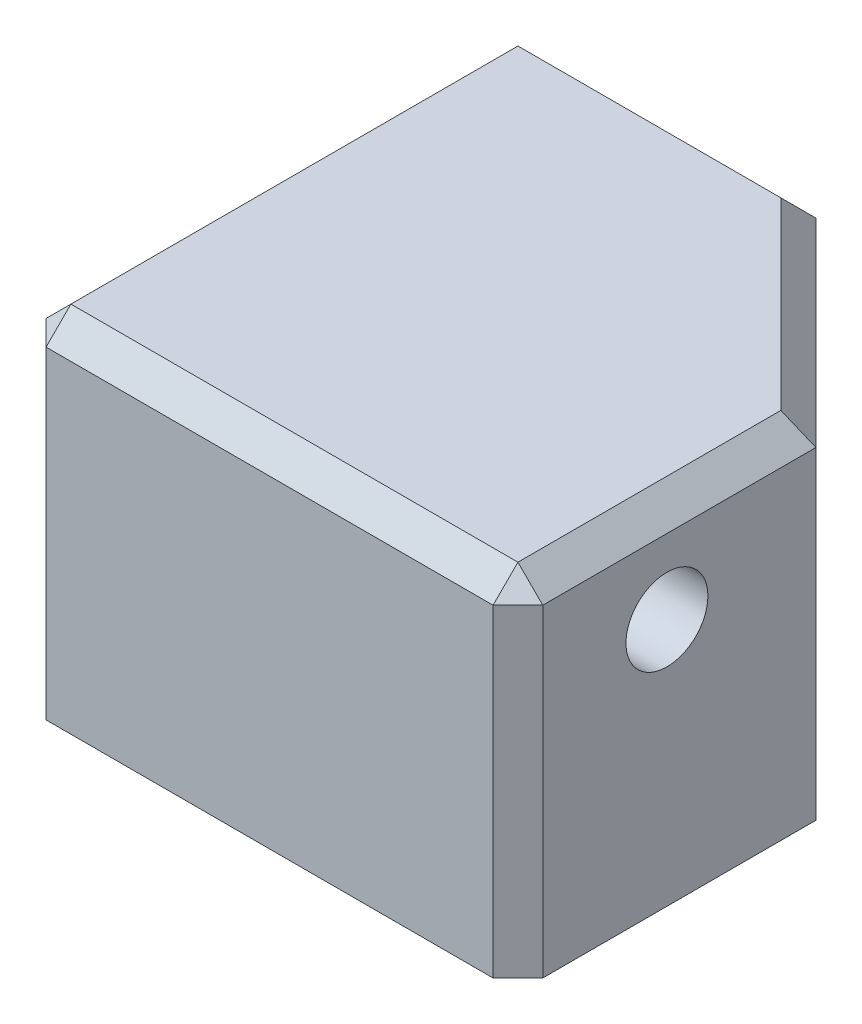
ISO-10303-21;
HEADER;
FILE_DESCRIPTION(('STEP AP214'),'2;1');
FILE_NAME('part.step','',(''),(''),'','','');
FILE_SCHEMA(('AUTOMOTIVE_DESIGN { 1 0 10303 214 1 1 1 1 }'));
ENDSEC;
DATA;
#1=APPLICATION_CONTEXT('core data for automotive mechanical design processes');
#2=APPLICATION_PROTOCOL_DEFINITION('international standard','automotive_design',2000,#1);
#3=PRODUCT_CONTEXT('',#1,'mechanical');
#4=PRODUCT('Part','Part','',(#3));
#5=PRODUCT_RELATED_PRODUCT_CATEGORY('part','',(#4));
#6=PRODUCT_DEFINITION_FORMATION('','',#4);
#7=PRODUCT_DEFINITION_CONTEXT('part definition',#1,'design');
#8=PRODUCT_DEFINITION('design','',#6,#7);
#9=PRODUCT_DEFINITION_SHAPE('','',#8);
#10=(LENGTH_UNIT() NAMED_UNIT(*) SI_UNIT(.MILLI.,.METRE.));
#11=(NAMED_UNIT(*) PLANE_ANGLE_UNIT() SI_UNIT($,.RADIAN.));
#12=(NAMED_UNIT(*) SI_UNIT($,.STERADIAN.) SOLID_ANGLE_UNIT());
#13=UNCERTAINTY_MEASURE_WITH_UNIT(LENGTH_MEASURE(1.E-05),#10,'distance_accuracy_value','');
#14=(GEOMETRIC_REPRESENTATION_CONTEXT(3) GLOBAL_UNCERTAINTY_ASSIGNED_CONTEXT((#13)) GLOBAL_UNIT_ASSIGNED_CONTEXT((#10,
#11,#12)) REPRESENTATION_CONTEXT('',''));
#15=CARTESIAN_POINT('',(0.,0.,0.));
#16=DIRECTION('',(0.,0.,1.));
#17=DIRECTION('',(1.,0.,0.));
#18=AXIS2_PLACEMENT_3D('',#15,#16,#17);
#19=CARTESIAN_POINT('',(10.,7.,0.));
#20=DIRECTION('',(0.,0.,-1.));
#21=DIRECTION('',(-1.,0.,0.));
#22=AXIS2_PLACEMENT_3D('',#19,#20,#21);
#23=PLANE('',#22);
#24=DIRECTION('',(1.,0.,0.));
#25=VECTOR('',#24,1.);
#26=CARTESIAN_POINT('',(10.,0.,0.));
#27=LINE('',#26,#25);
#28=CARTESIAN_POINT('',(0.5,0.,0.));
#29=VERTEX_POINT('',#28);
#30=CARTESIAN_POINT('',(9.5,0.,0.));
#31=VERTEX_POINT('',#30);
#32=EDGE_CURVE('E209',#29,#31,#27,.T.);
#33=ORIENTED_EDGE('',*,*,#32,.T.);
#34=DIRECTION('',(0.,1.,0.));
#35=VECTOR('',#34,1.);
#36=CARTESIAN_POINT('',(9.5,7.,0.));
#37=LINE('',#36,#35);
#38=CARTESIAN_POINT('',(9.5,6.5,0.));
#39=VERTEX_POINT('',#38);
#40=EDGE_CURVE('E410',#31,#39,#37,.T.);
#41=ORIENTED_EDGE('',*,*,#40,.T.);
#42=DIRECTION('',(-1.,0.,0.));
#43=VECTOR('',#42,1.);
#44=CARTESIAN_POINT('',(10.,6.5,0.));
#45=LINE('',#44,#43);
#46=CARTESIAN_POINT('',(0.5,6.5,0.));
#47=VERTEX_POINT('',#46);
#48=EDGE_CURVE('E408',#39,#47,#45,.T.);
#49=ORIENTED_EDGE('',*,*,#48,.T.);
#50=DIRECTION('',(0.,-1.,0.));
#51=VECTOR('',#50,1.);
#52=CARTESIAN_POINT('',(0.5,7.,0.));
#53=LINE('',#52,#51);
#54=EDGE_CURVE('E406',#47,#29,#53,.T.);
#55=ORIENTED_EDGE('',*,*,#54,.T.);
#56=EDGE_LOOP('',(#33,#41,#49,#55));
#57=FACE_BOUND('',#56,.T.);
#58=ADVANCED_FACE('F37',(#57),#23,.F.);
#59=CARTESIAN_POINT('',(10.,7.,-6.));
#60=DIRECTION('',(-1.,0.,0.));
#61=DIRECTION('',(0.,0.,1.));
#62=AXIS2_PLACEMENT_3D('',#59,#60,#61);
#63=PLANE('',#62);
#64=CARTESIAN_POINT('',(10.,5.,-3.));
#65=DIRECTION('',(1.,0.,0.));
#66=DIRECTION('',(0.,0.,-1.));
#67=AXIS2_PLACEMENT_3D('',#64,#65,#66);
#68=CIRCLE('',#67,0.824999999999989);
#69=CARTESIAN_POINT('',(10.,5.,-3.82499999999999));
#70=VERTEX_POINT('',#69);
#71=EDGE_CURVE('E203',#70,#70,#68,.T.);
#72=ORIENTED_EDGE('',*,*,#71,.F.);
#73=EDGE_LOOP('',(#72));
#74=FACE_BOUND('',#73,.T.);
#75=DIRECTION('',(0.,0.,1.));
#76=VECTOR('',#75,1.);
#77=CARTESIAN_POINT('',(10.,6.5,-6.));
#78=LINE('',#77,#76);
#79=CARTESIAN_POINT('',(10.,6.5,-6.));
#80=VERTEX_POINT('',#79);
#81=CARTESIAN_POINT('',(10.,6.5,-0.500000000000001));
#82=VERTEX_POINT('',#81);
#83=EDGE_CURVE('E381',#80,#82,#78,.T.);
#84=ORIENTED_EDGE('',*,*,#83,.T.);
#85=DIRECTION('',(0.,-1.,0.));
#86=VECTOR('',#85,1.);
#87=CARTESIAN_POINT('',(10.,7.,-0.500000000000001));
#88=LINE('',#87,#86);
#89=CARTESIAN_POINT('',(10.,0.,-0.500000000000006));
#90=VERTEX_POINT('',#89);
#91=EDGE_CURVE('E386',#82,#90,#88,.T.);
#92=ORIENTED_EDGE('',*,*,#91,.T.);
#93=DIRECTION('',(0.,0.,-1.));
#94=VECTOR('',#93,1.);
#95=CARTESIAN_POINT('',(10.,0.,-6.));
#96=LINE('',#95,#94);
#97=CARTESIAN_POINT('',(10.,0.,-6.));
#98=VERTEX_POINT('',#97);
#99=EDGE_CURVE('E212',#90,#98,#96,.T.);
#100=ORIENTED_EDGE('',*,*,#99,.T.);
#101=DIRECTION('',(0.,-1.,0.));
#102=VECTOR('',#101,1.);
#103=CARTESIAN_POINT('',(10.,7.,-6.));
#104=LINE('',#103,#102);
#105=EDGE_CURVE('E226',#80,#98,#104,.T.);
#106=ORIENTED_EDGE('',*,*,#105,.F.);
#107=EDGE_LOOP('',(#84,#92,#100,#106));
#108=FACE_BOUND('',#107,.T.);
#109=ADVANCED_FACE('F270',(#74,#108),#63,.F.);
#110=CARTESIAN_POINT('',(6.,7.,-10.));
#111=DIRECTION('',(-0.707106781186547,0.,0.707106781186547));
#112=DIRECTION('',(0.707106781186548,0.,0.707106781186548));
#113=AXIS2_PLACEMENT_3D('',#110,#111,#112);
#114=PLANE('',#113);
#115=CARTESIAN_POINT('',(8.,5.,-8.00000000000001));
#116=DIRECTION('',(0.707106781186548,0.,-0.707106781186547));
#117=DIRECTION('',(-0.707106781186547,0.,-0.707106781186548));
#118=AXIS2_PLACEMENT_3D('',#115,#116,#117);
#119=CIRCLE('',#118,0.824999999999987);
#120=CARTESIAN_POINT('',(7.41663690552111,5.,-8.5833630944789));
#121=VERTEX_POINT('',#120);
#122=EDGE_CURVE('E181',#121,#121,#119,.T.);
#123=ORIENTED_EDGE('',*,*,#122,.F.);
#124=EDGE_LOOP('',(#123));
#125=FACE_BOUND('',#124,.T.);
#126=DIRECTION('',(0.,-1.,0.));
#127=VECTOR('',#126,1.);
#128=CARTESIAN_POINT('',(6.,7.,-10.));
#129=LINE('',#128,#127);
#130=CARTESIAN_POINT('',(6.,6.5,-10.));
#131=VERTEX_POINT('',#130);
#132=CARTESIAN_POINT('',(6.,0.,-10.));
#133=VERTEX_POINT('',#132);
#134=EDGE_CURVE('E224',#131,#133,#129,.T.);
#135=ORIENTED_EDGE('',*,*,#134,.F.);
#136=DIRECTION('',(0.707106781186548,0.,0.707106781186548));
#137=VECTOR('',#136,1.);
#138=CARTESIAN_POINT('',(6.,6.5,-10.));
#139=LINE('',#138,#137);
#140=EDGE_CURVE('E11',#131,#80,#139,.T.);
#141=ORIENTED_EDGE('',*,*,#140,.T.);
#142=ORIENTED_EDGE('',*,*,#105,.T.);
#143=DIRECTION('',(-0.707106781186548,0.,-0.707106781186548));
#144=VECTOR('',#143,1.);
#145=CARTESIAN_POINT('',(6.,0.,-10.));
#146=LINE('',#145,#144);
#147=EDGE_CURVE('E215',#98,#133,#146,.T.);
#148=ORIENTED_EDGE('',*,*,#147,.T.);
#149=EDGE_LOOP('',(#135,#141,#142,#148));
#150=FACE_BOUND('',#149,.T.);
#151=ADVANCED_FACE('F266',(#125,#150),#114,.F.);
#152=CARTESIAN_POINT('',(0.,7.,-10.));
#153=DIRECTION('',(0.,0.,1.));
#154=DIRECTION('',(1.,0.,0.));
#155=AXIS2_PLACEMENT_3D('',#152,#153,#154);
#156=PLANE('',#155);
#157=CARTESIAN_POINT('',(3.,5.,-10.));
#158=DIRECTION('',(0.,0.,-1.));
#159=DIRECTION('',(-1.,0.,0.));
#160=AXIS2_PLACEMENT_3D('',#157,#158,#159);
#161=CIRCLE('',#160,0.824999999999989);
#162=CARTESIAN_POINT('',(2.17500000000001,5.,-10.));
#163=VERTEX_POINT('',#162);
#164=EDGE_CURVE('E197',#163,#163,#161,.T.);
#165=ORIENTED_EDGE('',*,*,#164,.F.);
#166=EDGE_LOOP('',(#165));
#167=FACE_BOUND('',#166,.T.);
#168=DIRECTION('',(-1.,0.,0.));
#169=VECTOR('',#168,1.);
#170=CARTESIAN_POINT('',(0.,0.,-10.));
#171=LINE('',#170,#169);
#172=CARTESIAN_POINT('',(0.5,0.,-10.));
#173=VERTEX_POINT('',#172);
#174=EDGE_CURVE('E218',#133,#173,#171,.T.);
#175=ORIENTED_EDGE('',*,*,#174,.T.);
#176=DIRECTION('',(0.,1.,0.));
#177=VECTOR('',#176,1.);
#178=CARTESIAN_POINT('',(0.5,7.,-10.));
#179=LINE('',#178,#177);
#180=CARTESIAN_POINT('',(0.5,6.5,-10.));
#181=VERTEX_POINT('',#180);
#182=EDGE_CURVE('E338',#173,#181,#179,.T.);
#183=ORIENTED_EDGE('',*,*,#182,.T.);
#184=DIRECTION('',(1.,0.,0.));
#185=VECTOR('',#184,1.);
#186=CARTESIAN_POINT('',(0.,6.5,-10.));
#187=LINE('',#186,#185);
#188=EDGE_CURVE('E332',#181,#131,#187,.T.);
#189=ORIENTED_EDGE('',*,*,#188,.T.);
#190=ORIENTED_EDGE('',*,*,#134,.T.);
#191=EDGE_LOOP('',(#175,#183,#189,#190));
#192=FACE_BOUND('',#191,.T.);
#193=ADVANCED_FACE('F262',(#167,#192),#156,.F.);
#194=CARTESIAN_POINT('',(0.,7.,0.));
#195=DIRECTION('',(1.,0.,0.));
#196=DIRECTION('',(0.,0.,-1.));
#197=AXIS2_PLACEMENT_3D('',#194,#195,#196);
#198=PLANE('',#197);
#199=DIRECTION('',(0.,0.,-1.));
#200=VECTOR('',#199,1.);
#201=CARTESIAN_POINT('',(0.,6.5,0.));
#202=LINE('',#201,#200);
#203=CARTESIAN_POINT('',(0.,6.5,-0.500000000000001));
#204=VERTEX_POINT('',#203);
#205=CARTESIAN_POINT('',(0.,6.5,-9.5));
#206=VERTEX_POINT('',#205);
#207=EDGE_CURVE('E343',#204,#206,#202,.T.);
#208=ORIENTED_EDGE('',*,*,#207,.T.);
#209=DIRECTION('',(0.,-1.,0.));
#210=VECTOR('',#209,1.);
#211=CARTESIAN_POINT('',(0.,7.,-9.5));
#212=LINE('',#211,#210);
#213=CARTESIAN_POINT('',(0.,0.,-9.5));
#214=VERTEX_POINT('',#213);
#215=EDGE_CURVE('E339',#206,#214,#212,.T.);
#216=ORIENTED_EDGE('',*,*,#215,.T.);
#217=DIRECTION('',(0.,0.,1.));
#218=VECTOR('',#217,1.);
#219=CARTESIAN_POINT('',(0.,0.,0.));
#220=LINE('',#219,#218);
#221=CARTESIAN_POINT('',(0.,0.,-0.500000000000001));
#222=VERTEX_POINT('',#221);
#223=EDGE_CURVE('E221',#214,#222,#220,.T.);
#224=ORIENTED_EDGE('',*,*,#223,.T.);
#225=DIRECTION('',(0.,1.,0.));
#226=VECTOR('',#225,1.);
#227=CARTESIAN_POINT('',(0.,7.,-0.500000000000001));
#228=LINE('',#227,#226);
#229=EDGE_CURVE('E412',#222,#204,#228,.T.);
#230=ORIENTED_EDGE('',*,*,#229,.T.);
#231=EDGE_LOOP('',(#208,#216,#224,#230));
#232=FACE_BOUND('',#231,.T.);
#233=ADVANCED_FACE('F256',(#232),#198,.F.);
#234=CARTESIAN_POINT('',(0.,7.,0.));
#235=DIRECTION('',(0.,-1.,0.));
#236=DIRECTION('',(0.,0.,-1.));
#237=AXIS2_PLACEMENT_3D('',#234,#235,#236);
#238=PLANE('',#237);
#239=DIRECTION('',(1.,0.,0.));
#240=VECTOR('',#239,1.);
#241=CARTESIAN_POINT('',(0.,7.,-0.5));
#242=LINE('',#241,#240);
#243=CARTESIAN_POINT('',(0.5,7.,-0.500000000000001));
#244=VERTEX_POINT('',#243);
#245=CARTESIAN_POINT('',(9.5,7.,-0.500000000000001));
#246=VERTEX_POINT('',#245);
#247=EDGE_CURVE('E348',#244,#246,#242,.T.);
#248=ORIENTED_EDGE('',*,*,#247,.T.);
#249=DIRECTION('',(0.,0.,-1.));
#250=VECTOR('',#249,1.);
#251=CARTESIAN_POINT('',(9.5,7.,0.));
#252=LINE('',#251,#250);
#253=CARTESIAN_POINT('',(9.5,7.,-5.79289321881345));
#254=VERTEX_POINT('',#253);
#255=EDGE_CURVE('E46',#246,#254,#252,.T.);
#256=ORIENTED_EDGE('',*,*,#255,.T.);
#257=DIRECTION('',(-0.707106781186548,0.,-0.707106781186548));
#258=VECTOR('',#257,1.);
#259=CARTESIAN_POINT('',(7.64644660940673,7.,-7.64644660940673));
#260=LINE('',#259,#258);
#261=CARTESIAN_POINT('',(5.79289321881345,7.,-9.5));
#262=VERTEX_POINT('',#261);
#263=EDGE_CURVE('E61',#254,#262,#260,.T.);
#264=ORIENTED_EDGE('',*,*,#263,.T.);
#265=DIRECTION('',(-1.,0.,0.));
#266=VECTOR('',#265,1.);
#267=CARTESIAN_POINT('',(0.,7.,-9.5));
#268=LINE('',#267,#266);
#269=CARTESIAN_POINT('',(0.5,7.,-9.5));
#270=VERTEX_POINT('',#269);
#271=EDGE_CURVE('E350',#262,#270,#268,.T.);
#272=ORIENTED_EDGE('',*,*,#271,.T.);
#273=DIRECTION('',(0.,0.,1.));
#274=VECTOR('',#273,1.);
#275=CARTESIAN_POINT('',(0.5,7.,0.));
#276=LINE('',#275,#274);
#277=EDGE_CURVE('E341',#270,#244,#276,.T.);
#278=ORIENTED_EDGE('',*,*,#277,.T.);
#279=EDGE_LOOP('',(#248,#256,#264,#272,#278));
#280=FACE_BOUND('',#279,.T.);
#281=ADVANCED_FACE('F252',(#280),#238,.F.);
#282=CARTESIAN_POINT('',(0.,0.,0.));
#283=DIRECTION('',(0.,-1.,0.));
#284=DIRECTION('',(0.,0.,-1.));
#285=AXIS2_PLACEMENT_3D('',#282,#283,#284);
#286=PLANE('',#285);
#287=CARTESIAN_POINT('',(5.1,0.,-8.));
#288=DIRECTION('',(0.,-1.,0.));
#289=DIRECTION('',(0.,0.,-1.));
#290=AXIS2_PLACEMENT_3D('',#287,#288,#289);
#291=CIRCLE('',#290,0.625);
#292=CARTESIAN_POINT('',(5.1,0.,-8.625));
#293=VERTEX_POINT('',#292);
#294=EDGE_CURVE('E165',#293,#293,#291,.T.);
#295=ORIENTED_EDGE('',*,*,#294,.F.);
#296=EDGE_LOOP('',(#295));
#297=FACE_BOUND('',#296,.T.);
#298=CARTESIAN_POINT('',(8.,0.,-5.1));
#299=DIRECTION('',(0.,-1.,0.));
#300=DIRECTION('',(0.,0.,-1.));
#301=AXIS2_PLACEMENT_3D('',#298,#299,#300);
#302=CIRCLE('',#301,0.624999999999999);
#303=CARTESIAN_POINT('',(8.,0.,-5.725));
#304=VERTEX_POINT('',#303);
#305=EDGE_CURVE('E164',#304,#304,#302,.T.);
#306=ORIENTED_EDGE('',*,*,#305,.F.);
#307=EDGE_LOOP('',(#306));
#308=FACE_BOUND('',#307,.T.);
#309=CARTESIAN_POINT('',(2.,0.,-2.));
#310=DIRECTION('',(0.,-1.,0.));
#311=DIRECTION('',(0.,0.,-1.));
#312=AXIS2_PLACEMENT_3D('',#309,#310,#311);
#313=CIRCLE('',#312,0.625);
#314=CARTESIAN_POINT('',(2.,0.,-2.625));
#315=VERTEX_POINT('',#314);
#316=EDGE_CURVE('E175',#315,#315,#313,.T.);
#317=ORIENTED_EDGE('',*,*,#316,.F.);
#318=EDGE_LOOP('',(#317));
#319=FACE_BOUND('',#318,.T.);
#320=ORIENTED_EDGE('',*,*,#99,.F.);
#321=DIRECTION('',(0.707106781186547,0.,-0.707106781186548));
#322=VECTOR('',#321,1.);
#323=CARTESIAN_POINT('',(4.75,0.,4.75));
#324=LINE('',#323,#322);
#325=EDGE_CURVE('E400',#90,#31,#324,.F.);
#326=ORIENTED_EDGE('',*,*,#325,.T.);
#327=ORIENTED_EDGE('',*,*,#32,.F.);
#328=DIRECTION('',(0.707106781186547,0.,0.707106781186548));
#329=VECTOR('',#328,1.);
#330=CARTESIAN_POINT('',(0.25,0.,-0.25));
#331=LINE('',#330,#329);
#332=EDGE_CURVE('E397',#29,#222,#331,.F.);
#333=ORIENTED_EDGE('',*,*,#332,.T.);
#334=ORIENTED_EDGE('',*,*,#223,.F.);
#335=DIRECTION('',(-0.707106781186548,0.,0.707106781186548));
#336=VECTOR('',#335,1.);
#337=CARTESIAN_POINT('',(-4.75,0.,-4.75));
#338=LINE('',#337,#336);
#339=EDGE_CURVE('E391',#214,#173,#338,.F.);
#340=ORIENTED_EDGE('',*,*,#339,.T.);
#341=ORIENTED_EDGE('',*,*,#174,.F.);
#342=ORIENTED_EDGE('',*,*,#147,.F.);
#343=EDGE_LOOP('',(#320,#326,#327,#333,#334,#340,#341,#342));
#344=FACE_BOUND('',#343,.T.);
#345=ADVANCED_FACE('F250',(#297,#308,#319,#344),#286,.T.);
#346=CARTESIAN_POINT('',(3.,5.,-3.));
#347=DIRECTION('',(1.,0.,0.));
#348=DIRECTION('',(0.,0.,-1.));
#349=AXIS2_PLACEMENT_3D('',#346,#347,#348);
#350=CONICAL_SURFACE('',#349,0.824999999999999,0.785398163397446);
#351=CARTESIAN_POINT('',(2.5875,5.,-2.5875));
#352=CARTESIAN_POINT('',(2.58749515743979,4.98861170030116,-2.58749515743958));
#353=CARTESIAN_POINT('',(2.58773324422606,4.97721942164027,-2.58773324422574));
#354=CARTESIAN_POINT('',(2.58962789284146,4.93173148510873,-2.58962789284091));
#355=CARTESIAN_POINT('',(2.59316826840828,4.89775953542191,-2.59316826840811));
#356=CARTESIAN_POINT('',(2.60411432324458,4.83107152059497,-2.6041143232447));
#357=CARTESIAN_POINT('',(2.61152830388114,4.79835831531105,-2.61152830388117));
#358=CARTESIAN_POINT('',(2.63345857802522,4.72086257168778,-2.63345857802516));
#359=CARTESIAN_POINT('',(2.64966242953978,4.67704471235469,-2.64966242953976));
#360=CARTESIAN_POINT('',(2.68670271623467,4.59322571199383,-2.68670271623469));
#361=CARTESIAN_POINT('',(2.70757428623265,4.55325699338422,-2.70757428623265));
#362=CARTESIAN_POINT('',(2.75175738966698,4.47808626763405,-2.75175738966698));
#363=CARTESIAN_POINT('',(2.77498311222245,4.44278134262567,-2.77498311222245));
#364=CARTESIAN_POINT('',(2.82350738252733,4.37505173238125,-2.82350738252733));
#365=CARTESIAN_POINT('',(2.8488098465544,4.34263274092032,-2.8488098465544));
#366=CARTESIAN_POINT('',(2.90004266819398,4.28124439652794,-2.90004266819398));
#367=CARTESIAN_POINT('',(2.92592757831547,4.25219819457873,-2.92592757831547));
#368=CARTESIAN_POINT('',(2.9786214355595,4.19618590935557,-2.9786214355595));
#369=CARTESIAN_POINT('',(3.00542570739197,4.16921106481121,-3.00542570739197));
#370=CARTESIAN_POINT('',(3.03258840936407,4.14303099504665,-3.03258840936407));
#371=B_SPLINE_CURVE_WITH_KNOTS('',3,(#351,#352,#353,#354,#355,#356,#357,#358,#359,#360,#361,
#362,#363,#364,#365,#366,#367,#368,#369,#370),.UNSPECIFIED.,.F.,.F.,(4,2,2,2,2,2,2,2,2,4),(0.,
0.0341720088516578,0.136630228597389,0.23930892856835,0.386807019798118,0.535455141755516,
0.679894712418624,0.824613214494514,0.964736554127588,1.10423019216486),.UNSPECIFIED.);
#372=CARTESIAN_POINT('',(3.,4.175,-3.));
#373=VERTEX_POINT('',#372);
#374=CARTESIAN_POINT('',(2.5875,5.,-2.5875));
#375=VERTEX_POINT('',#374);
#376=EDGE_CURVE('E228',#373,#375,#371,.F.);
#377=ORIENTED_EDGE('',*,*,#376,.T.);
#378=CARTESIAN_POINT('',(2.5875,5.,-2.5875));
#379=CARTESIAN_POINT('',(2.58749515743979,5.01138829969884,-2.58749515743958));
#380=CARTESIAN_POINT('',(2.58773324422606,5.02278057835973,-2.58773324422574));
#381=CARTESIAN_POINT('',(2.58962789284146,5.06826851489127,-2.58962789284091));
#382=CARTESIAN_POINT('',(2.59316826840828,5.1022404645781,-2.59316826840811));
#383=CARTESIAN_POINT('',(2.60411432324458,5.16892847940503,-2.6041143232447));
#384=CARTESIAN_POINT('',(2.61152830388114,5.20164168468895,-2.61152830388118));
#385=CARTESIAN_POINT('',(2.63345857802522,5.27913742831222,-2.63345857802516));
#386=CARTESIAN_POINT('',(2.64966242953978,5.32295528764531,-2.64966242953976));
#387=CARTESIAN_POINT('',(2.68670271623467,5.40677428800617,-2.68670271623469));
#388=CARTESIAN_POINT('',(2.70757428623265,5.44674300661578,-2.70757428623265));
#389=CARTESIAN_POINT('',(2.75175738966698,5.52191373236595,-2.75175738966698));
#390=CARTESIAN_POINT('',(2.77498311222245,5.55721865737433,-2.77498311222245));
#391=CARTESIAN_POINT('',(2.82350738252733,5.62494826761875,-2.82350738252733));
#392=CARTESIAN_POINT('',(2.8488098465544,5.65736725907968,-2.8488098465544));
#393=CARTESIAN_POINT('',(2.90004266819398,5.71875560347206,-2.90004266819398));
#394=CARTESIAN_POINT('',(2.92592757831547,5.74780180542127,-2.92592757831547));
#395=CARTESIAN_POINT('',(2.9786214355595,5.80381409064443,-2.9786214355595));
#396=CARTESIAN_POINT('',(3.00542570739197,5.83078893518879,-3.00542570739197));
#397=CARTESIAN_POINT('',(3.03258840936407,5.85696900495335,-3.03258840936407));
#398=B_SPLINE_CURVE_WITH_KNOTS('',3,(#378,#379,#380,#381,#382,#383,#384,#385,#386,#387,#388,
#389,#390,#391,#392,#393,#394,#395,#396,#397),.UNSPECIFIED.,.F.,.F.,(4,2,2,2,2,2,2,2,2,4),(0.,
0.0341720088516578,0.13663022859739,0.23930892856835,0.386807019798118,0.535455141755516,
0.679894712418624,0.824613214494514,0.964736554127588,1.10423019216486),.UNSPECIFIED.);
#399=CARTESIAN_POINT('',(3.,5.82499999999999,-3.));
#400=VERTEX_POINT('',#399);
#401=EDGE_CURVE('E236',#375,#400,#398,.T.);
#402=ORIENTED_EDGE('',*,*,#401,.T.);
#403=CARTESIAN_POINT('',(3.,5.,-3.));
#404=DIRECTION('',(1.,0.,0.));
#405=DIRECTION('',(0.,0.,-1.));
#406=AXIS2_PLACEMENT_3D('',#403,#404,#405);
#407=CIRCLE('',#406,0.824999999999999);
#408=EDGE_CURVE('E206',#400,#373,#407,.T.);
#409=ORIENTED_EDGE('',*,*,#408,.T.);
#410=EDGE_LOOP('',(#377,#402,#409));
#411=FACE_BOUND('',#410,.T.);
#412=ADVANCED_FACE('F245',(#411),#350,.F.);
#413=CARTESIAN_POINT('',(10.,5.,-3.));
#414=DIRECTION('',(1.,0.,0.));
#415=DIRECTION('',(0.,0.,-1.));
#416=AXIS2_PLACEMENT_3D('',#413,#414,#415);
#417=CYLINDRICAL_SURFACE('',#416,0.824999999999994);
#418=CARTESIAN_POINT('',(3.,5.,-3.));
#419=DIRECTION('',(0.707106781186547,0.,0.707106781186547));
#420=DIRECTION('',(0.707106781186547,0.,-0.707106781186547));
#421=AXIS2_PLACEMENT_3D('',#418,#419,#420);
#422=ELLIPSE('',#421,1.16672618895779,0.824999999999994);
#423=CARTESIAN_POINT('',(3.20625,5.79880281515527,-3.20625));
#424=VERTEX_POINT('',#423);
#425=EDGE_CURVE('E424',#400,#424,#422,.F.);
#426=ORIENTED_EDGE('',*,*,#425,.T.);
#427=CARTESIAN_POINT('',(3.41249999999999,5.,-3.));
#428=DIRECTION('',(-0.707106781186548,0.,0.707106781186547));
#429=DIRECTION('',(0.707106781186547,0.,0.707106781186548));
#430=AXIS2_PLACEMENT_3D('',#427,#428,#429);
#431=ELLIPSE('',#430,1.16672618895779,0.824999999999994);
#432=CARTESIAN_POINT('',(3.29168154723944,5.81610532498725,-3.12081845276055));
#433=VERTEX_POINT('',#432);
#434=EDGE_CURVE('E194',#424,#433,#431,.F.);
#435=ORIENTED_EDGE('',*,*,#434,.T.);
#436=CARTESIAN_POINT('',(3.,5.,-3.));
#437=DIRECTION('',(0.38268343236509,0.,0.923879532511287));
#438=DIRECTION('',(0.923879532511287,0.,-0.38268343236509));
#439=AXIS2_PLACEMENT_3D('',#436,#437,#438);
#440=ELLIPSE('',#439,2.155828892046,0.824999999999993);
#441=CARTESIAN_POINT('',(3.29168154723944,4.18389467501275,-3.12081845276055));
#442=VERTEX_POINT('',#441);
#443=EDGE_CURVE('E188',#433,#442,#440,.F.);
#444=ORIENTED_EDGE('',*,*,#443,.T.);
#445=CARTESIAN_POINT('',(3.41249999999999,5.,-3.));
#446=DIRECTION('',(-0.707106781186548,0.,0.707106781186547));
#447=DIRECTION('',(0.707106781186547,0.,0.707106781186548));
#448=AXIS2_PLACEMENT_3D('',#445,#446,#447);
#449=ELLIPSE('',#448,1.16672618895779,0.824999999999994);
#450=CARTESIAN_POINT('',(3.20625,4.20119718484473,-3.20625));
#451=VERTEX_POINT('',#450);
#452=EDGE_CURVE('E191',#442,#451,#449,.F.);
#453=ORIENTED_EDGE('',*,*,#452,.T.);
#454=EDGE_CURVE('E426',#451,#373,#422,.F.);
#455=ORIENTED_EDGE('',*,*,#454,.T.);
#456=ORIENTED_EDGE('',*,*,#408,.F.);
#457=EDGE_LOOP('',(#426,#435,#444,#453,#455,#456));
#458=FACE_BOUND('',#457,.T.);
#459=ORIENTED_EDGE('',*,*,#71,.T.);
#460=EDGE_LOOP('',(#459));
#461=FACE_BOUND('',#460,.T.);
#462=ADVANCED_FACE('F249',(#458,#461),#417,.F.);
#463=CARTESIAN_POINT('',(3.,5.,-10.));
#464=DIRECTION('',(0.,0.,-1.));
#465=DIRECTION('',(-1.,0.,0.));
#466=AXIS2_PLACEMENT_3D('',#463,#464,#465);
#467=CYLINDRICAL_SURFACE('',#466,0.824999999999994);
#468=ORIENTED_EDGE('',*,*,#164,.T.);
#469=EDGE_LOOP('',(#468));
#470=FACE_BOUND('',#469,.T.);
#471=CARTESIAN_POINT('',(3.,5.,-3.));
#472=DIRECTION('',(-0.923879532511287,0.,-0.38268343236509));
#473=DIRECTION('',(0.38268343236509,0.,-0.923879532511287));
#474=AXIS2_PLACEMENT_3D('',#471,#472,#473);
#475=ELLIPSE('',#474,2.155828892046,0.824999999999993);
#476=CARTESIAN_POINT('',(3.12081845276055,4.18389467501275,-3.29168154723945));
#477=VERTEX_POINT('',#476);
#478=CARTESIAN_POINT('',(3.12081845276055,5.81610532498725,-3.29168154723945));
#479=VERTEX_POINT('',#478);
#480=EDGE_CURVE('E422',#477,#479,#475,.F.);
#481=ORIENTED_EDGE('',*,*,#480,.T.);
#482=CARTESIAN_POINT('',(3.,5.,-3.41249999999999));
#483=DIRECTION('',(-0.707106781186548,0.,0.707106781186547));
#484=DIRECTION('',(-0.707106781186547,0.,-0.707106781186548));
#485=AXIS2_PLACEMENT_3D('',#482,#483,#484);
#486=ELLIPSE('',#485,1.16672618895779,0.824999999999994);
#487=EDGE_CURVE('E416',#479,#424,#486,.F.);
#488=ORIENTED_EDGE('',*,*,#487,.T.);
#489=ORIENTED_EDGE('',*,*,#425,.F.);
#490=CARTESIAN_POINT('',(3.,5.,-3.));
#491=DIRECTION('',(0.,0.,-1.));
#492=DIRECTION('',(-1.,0.,0.));
#493=AXIS2_PLACEMENT_3D('',#490,#491,#492);
#494=CIRCLE('',#493,0.824999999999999);
#495=EDGE_CURVE('E200',#373,#400,#494,.T.);
#496=ORIENTED_EDGE('',*,*,#495,.F.);
#497=ORIENTED_EDGE('',*,*,#454,.F.);
#498=EDGE_CURVE('E418',#451,#477,#486,.F.);
#499=ORIENTED_EDGE('',*,*,#498,.T.);
#500=EDGE_LOOP('',(#481,#488,#489,#496,#497,#499));
#501=FACE_BOUND('',#500,.T.);
#502=ADVANCED_FACE('F436',(#470,#501),#467,.F.);
#503=CARTESIAN_POINT('',(3.,5.,-3.));
#504=DIRECTION('',(0.,0.,-1.));
#505=DIRECTION('',(-1.,0.,0.));
#506=AXIS2_PLACEMENT_3D('',#503,#504,#505);
#507=CONICAL_SURFACE('',#506,0.824999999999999,0.785398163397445);
#508=ORIENTED_EDGE('',*,*,#495,.T.);
#509=ORIENTED_EDGE('',*,*,#401,.F.);
#510=ORIENTED_EDGE('',*,*,#376,.F.);
#511=EDGE_LOOP('',(#508,#509,#510));
#512=FACE_BOUND('',#511,.T.);
#513=ADVANCED_FACE('F241',(#512),#507,.F.);
#514=CARTESIAN_POINT('',(3.20624999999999,5.,-3.20625));
#515=DIRECTION('',(-0.707106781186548,0.,0.707106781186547));
#516=DIRECTION('',(0.707106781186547,0.,0.707106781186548));
#517=AXIS2_PLACEMENT_3D('',#514,#515,#516);
#518=PLANE('',#517);
#519=ORIENTED_EDGE('',*,*,#487,.F.);
#520=CARTESIAN_POINT('',(3.20624999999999,5.,-3.20625));
#521=DIRECTION('',(0.707106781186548,0.,-0.707106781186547));
#522=DIRECTION('',(-0.707106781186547,0.,-0.707106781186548));
#523=AXIS2_PLACEMENT_3D('',#520,#521,#522);
#524=CIRCLE('',#523,0.824999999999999);
#525=EDGE_CURVE('E185',#479,#433,#524,.T.);
#526=ORIENTED_EDGE('',*,*,#525,.T.);
#527=ORIENTED_EDGE('',*,*,#434,.F.);
#528=EDGE_LOOP('',(#519,#526,#527));
#529=FACE_BOUND('',#528,.T.);
#530=ADVANCED_FACE('F445',(#529),#518,.F.);
#531=EDGE_CURVE('E184',#442,#477,#524,.T.);
#532=ORIENTED_EDGE('',*,*,#531,.T.);
#533=ORIENTED_EDGE('',*,*,#498,.F.);
#534=ORIENTED_EDGE('',*,*,#452,.F.);
#535=EDGE_LOOP('',(#532,#533,#534));
#536=FACE_BOUND('',#535,.T.);
#537=ADVANCED_FACE('F450',(#536),#518,.F.);
#538=CARTESIAN_POINT('',(8.,5.,-8.));
#539=DIRECTION('',(0.707106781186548,0.,-0.707106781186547));
#540=DIRECTION('',(-0.707106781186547,0.,-0.707106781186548));
#541=AXIS2_PLACEMENT_3D('',#538,#539,#540);
#542=CYLINDRICAL_SURFACE('',#541,0.824999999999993);
#543=ORIENTED_EDGE('',*,*,#122,.T.);
#544=EDGE_LOOP('',(#543));
#545=FACE_BOUND('',#544,.T.);
#546=ORIENTED_EDGE('',*,*,#525,.F.);
#547=ORIENTED_EDGE('',*,*,#480,.F.);
#548=ORIENTED_EDGE('',*,*,#531,.F.);
#549=ORIENTED_EDGE('',*,*,#443,.F.);
#550=EDGE_LOOP('',(#546,#547,#548,#549));
#551=FACE_BOUND('',#550,.T.);
#552=ADVANCED_FACE('F452',(#545,#551),#542,.F.);
#553=CARTESIAN_POINT('',(2.,3.5,-2.));
#554=DIRECTION('',(0.,-1.,0.));
#555=DIRECTION('',(0.,0.,-1.));
#556=AXIS2_PLACEMENT_3D('',#553,#554,#555);
#557=CONICAL_SURFACE('',#556,0.624999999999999,1.02974425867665);
#558=CARTESIAN_POINT('',(2.,3.87553788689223,-2.));
#559=VERTEX_POINT('',#558);
#560=VERTEX_LOOP('',#559);
#561=FACE_BOUND('',#560,.T.);
#562=CARTESIAN_POINT('',(2.,3.5,-2.));
#563=DIRECTION('',(0.,-1.,0.));
#564=DIRECTION('',(0.,0.,-1.));
#565=AXIS2_PLACEMENT_3D('',#562,#563,#564);
#566=CIRCLE('',#565,0.624999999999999);
#567=CARTESIAN_POINT('',(2.,3.5,-2.625));
#568=VERTEX_POINT('',#567);
#569=EDGE_CURVE('E178',#568,#568,#566,.T.);
#570=ORIENTED_EDGE('',*,*,#569,.T.);
#571=EDGE_LOOP('',(#570));
#572=FACE_BOUND('',#571,.T.);
#573=ADVANCED_FACE('F455',(#561,#572),#557,.F.);
#574=CARTESIAN_POINT('',(2.,0.,-2.));
#575=DIRECTION('',(0.,-1.,0.));
#576=DIRECTION('',(0.,0.,-1.));
#577=AXIS2_PLACEMENT_3D('',#574,#575,#576);
#578=CYLINDRICAL_SURFACE('',#577,0.624999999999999);
#579=ORIENTED_EDGE('',*,*,#569,.F.);
#580=EDGE_LOOP('',(#579));
#581=FACE_BOUND('',#580,.T.);
#582=ORIENTED_EDGE('',*,*,#316,.T.);
#583=EDGE_LOOP('',(#582));
#584=FACE_BOUND('',#583,.T.);
#585=ADVANCED_FACE('F459',(#581,#584),#578,.F.);
#586=CARTESIAN_POINT('',(8.,3.5,-5.1));
#587=DIRECTION('',(0.,-1.,0.));
#588=DIRECTION('',(0.,0.,-1.));
#589=AXIS2_PLACEMENT_3D('',#586,#587,#588);
#590=CONICAL_SURFACE('',#589,0.624999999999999,1.02974425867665);
#591=CARTESIAN_POINT('',(8.,3.87553788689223,-5.1));
#592=VERTEX_POINT('',#591);
#593=VERTEX_LOOP('',#592);
#594=FACE_BOUND('',#593,.T.);
#595=CARTESIAN_POINT('',(8.,3.5,-5.1));
#596=DIRECTION('',(0.,-1.,0.));
#597=DIRECTION('',(0.,0.,-1.));
#598=AXIS2_PLACEMENT_3D('',#595,#596,#597);
#599=CIRCLE('',#598,0.624999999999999);
#600=CARTESIAN_POINT('',(8.,3.5,-5.725));
#601=VERTEX_POINT('',#600);
#602=EDGE_CURVE('E168',#601,#601,#599,.T.);
#603=ORIENTED_EDGE('',*,*,#602,.T.);
#604=EDGE_LOOP('',(#603));
#605=FACE_BOUND('',#604,.T.);
#606=ADVANCED_FACE('F463',(#594,#605),#590,.F.);
#607=CARTESIAN_POINT('',(8.,0.,-5.1));
#608=DIRECTION('',(0.,-1.,0.));
#609=DIRECTION('',(0.,0.,-1.));
#610=AXIS2_PLACEMENT_3D('',#607,#608,#609);
#611=CYLINDRICAL_SURFACE('',#610,0.624999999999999);
#612=ORIENTED_EDGE('',*,*,#602,.F.);
#613=EDGE_LOOP('',(#612));
#614=FACE_BOUND('',#613,.T.);
#615=ORIENTED_EDGE('',*,*,#305,.T.);
#616=EDGE_LOOP('',(#615));
#617=FACE_BOUND('',#616,.T.);
#618=ADVANCED_FACE('F158',(#614,#617),#611,.F.);
#619=CARTESIAN_POINT('',(5.1,3.5,-8.));
#620=DIRECTION('',(0.,-1.,0.));
#621=DIRECTION('',(0.,0.,-1.));
#622=AXIS2_PLACEMENT_3D('',#619,#620,#621);
#623=CONICAL_SURFACE('',#622,0.624999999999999,1.02974425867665);
#624=CARTESIAN_POINT('',(5.1,3.87553788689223,-8.));
#625=VERTEX_POINT('',#624);
#626=VERTEX_LOOP('',#625);
#627=FACE_BOUND('',#626,.T.);
#628=CARTESIAN_POINT('',(5.1,3.5,-8.));
#629=DIRECTION('',(0.,-1.,0.));
#630=DIRECTION('',(0.,0.,-1.));
#631=AXIS2_PLACEMENT_3D('',#628,#629,#630);
#632=CIRCLE('',#631,0.624999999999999);
#633=CARTESIAN_POINT('',(5.1,3.5,-8.625));
#634=VERTEX_POINT('',#633);
#635=EDGE_CURVE('E162',#634,#634,#632,.T.);
#636=ORIENTED_EDGE('',*,*,#635,.T.);
#637=EDGE_LOOP('',(#636));
#638=FACE_BOUND('',#637,.T.);
#639=ADVANCED_FACE('F154',(#627,#638),#623,.F.);
#640=CARTESIAN_POINT('',(5.1,0.,-8.));
#641=DIRECTION('',(0.,-1.,0.));
#642=DIRECTION('',(0.,0.,-1.));
#643=AXIS2_PLACEMENT_3D('',#640,#641,#642);
#644=CYLINDRICAL_SURFACE('',#643,0.624999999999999);
#645=ORIENTED_EDGE('',*,*,#635,.F.);
#646=EDGE_LOOP('',(#645));
#647=FACE_BOUND('',#646,.T.);
#648=ORIENTED_EDGE('',*,*,#294,.T.);
#649=EDGE_LOOP('',(#648));
#650=FACE_BOUND('',#649,.T.);
#651=ADVANCED_FACE('F157',(#647,#650),#644,.F.);
#652=CARTESIAN_POINT('',(0.,7.,-9.5));
#653=DIRECTION('',(0.707106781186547,0.,0.707106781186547));
#654=DIRECTION('',(0.,-1.,0.));
#655=AXIS2_PLACEMENT_3D('',#652,#653,#654);
#656=PLANE('',#655);
#657=DIRECTION('',(0.707106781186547,0.,-0.707106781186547));
#658=VECTOR('',#657,1.);
#659=CARTESIAN_POINT('',(0.5,6.5,-10.));
#660=LINE('',#659,#658);
#661=EDGE_CURVE('E41',#181,#206,#660,.F.);
#662=ORIENTED_EDGE('',*,*,#661,.F.);
#663=ORIENTED_EDGE('',*,*,#182,.F.);
#664=ORIENTED_EDGE('',*,*,#339,.F.);
#665=ORIENTED_EDGE('',*,*,#215,.F.);
#666=EDGE_LOOP('',(#662,#663,#664,#665));
#667=FACE_BOUND('',#666,.T.);
#668=ADVANCED_FACE('F39',(#667),#656,.F.);
#669=CARTESIAN_POINT('',(0.5,6.5,-10.));
#670=DIRECTION('',(-0.577350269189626,0.577350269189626,-0.577350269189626));
#671=DIRECTION('',(-0.707106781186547,0.,0.707106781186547));
#672=AXIS2_PLACEMENT_3D('',#669,#670,#671);
#673=PLANE('',#672);
#674=DIRECTION('',(0.,0.707106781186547,0.707106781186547));
#675=VECTOR('',#674,1.);
#676=CARTESIAN_POINT('',(0.5,6.5,-10.));
#677=LINE('',#676,#675);
#678=EDGE_CURVE('E323',#181,#270,#677,.T.);
#679=ORIENTED_EDGE('',*,*,#678,.F.);
#680=ORIENTED_EDGE('',*,*,#661,.T.);
#681=DIRECTION('',(-0.707106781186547,-0.707106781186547,0.));
#682=VECTOR('',#681,1.);
#683=CARTESIAN_POINT('',(0.25,6.75,-9.5));
#684=LINE('',#683,#682);
#685=EDGE_CURVE('E327',#270,#206,#684,.T.);
#686=ORIENTED_EDGE('',*,*,#685,.F.);
#687=EDGE_LOOP('',(#679,#680,#686));
#688=FACE_BOUND('',#687,.T.);
#689=ADVANCED_FACE('F311',(#688),#673,.T.);
#690=CARTESIAN_POINT('',(0.5,7.,0.));
#691=DIRECTION('',(0.707106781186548,0.,-0.707106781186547));
#692=DIRECTION('',(0.,-1.,0.));
#693=AXIS2_PLACEMENT_3D('',#690,#691,#692);
#694=PLANE('',#693);
#695=ORIENTED_EDGE('',*,*,#332,.F.);
#696=ORIENTED_EDGE('',*,*,#54,.F.);
#697=DIRECTION('',(-0.707106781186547,0.,-0.707106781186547));
#698=VECTOR('',#697,1.);
#699=CARTESIAN_POINT('',(0.5,6.5,0.));
#700=LINE('',#699,#698);
#701=EDGE_CURVE('E329',#204,#47,#700,.F.);
#702=ORIENTED_EDGE('',*,*,#701,.F.);
#703=ORIENTED_EDGE('',*,*,#229,.F.);
#704=EDGE_LOOP('',(#695,#696,#702,#703));
#705=FACE_BOUND('',#704,.T.);
#706=ADVANCED_FACE('F308',(#705),#694,.F.);
#707=CARTESIAN_POINT('',(0.5,7.,0.));
#708=DIRECTION('',(0.707106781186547,-0.707106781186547,0.));
#709=DIRECTION('',(0.,0.,1.));
#710=AXIS2_PLACEMENT_3D('',#707,#708,#709);
#711=PLANE('',#710);
#712=ORIENTED_EDGE('',*,*,#685,.T.);
#713=ORIENTED_EDGE('',*,*,#207,.F.);
#714=DIRECTION('',(0.707106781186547,0.707106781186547,0.));
#715=VECTOR('',#714,1.);
#716=CARTESIAN_POINT('',(0.25,6.75,-0.5));
#717=LINE('',#716,#715);
#718=EDGE_CURVE('E368',#244,#204,#717,.F.);
#719=ORIENTED_EDGE('',*,*,#718,.F.);
#720=ORIENTED_EDGE('',*,*,#277,.F.);
#721=EDGE_LOOP('',(#712,#713,#719,#720));
#722=FACE_BOUND('',#721,.T.);
#723=ADVANCED_FACE('F304',(#722),#711,.F.);
#724=CARTESIAN_POINT('',(0.,7.,-9.5));
#725=DIRECTION('',(0.,-0.707106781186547,0.707106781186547));
#726=DIRECTION('',(-1.,0.,0.));
#727=AXIS2_PLACEMENT_3D('',#724,#725,#726);
#728=PLANE('',#727);
#729=ORIENTED_EDGE('',*,*,#678,.T.);
#730=ORIENTED_EDGE('',*,*,#271,.F.);
#731=DIRECTION('',(0.281084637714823,-0.678598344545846,-0.678598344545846));
#732=VECTOR('',#731,1.);
#733=CARTESIAN_POINT('',(5.33520498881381,8.10495713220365,-8.39504286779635));
#734=LINE('',#733,#732);
#735=EDGE_CURVE('E334',#131,#262,#734,.F.);
#736=ORIENTED_EDGE('',*,*,#735,.F.);
#737=ORIENTED_EDGE('',*,*,#188,.F.);
#738=EDGE_LOOP('',(#729,#730,#736,#737));
#739=FACE_BOUND('',#738,.T.);
#740=ADVANCED_FACE('F300',(#739),#728,.F.);
#741=CARTESIAN_POINT('',(0.5,6.5,0.));
#742=DIRECTION('',(-0.577350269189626,0.577350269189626,0.577350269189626));
#743=DIRECTION('',(-0.707106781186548,-0.707106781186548,0.));
#744=AXIS2_PLACEMENT_3D('',#741,#742,#743);
#745=PLANE('',#744);
#746=ORIENTED_EDGE('',*,*,#718,.T.);
#747=ORIENTED_EDGE('',*,*,#701,.T.);
#748=DIRECTION('',(0.,-0.707106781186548,0.707106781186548));
#749=VECTOR('',#748,1.);
#750=CARTESIAN_POINT('',(0.5,6.5,0.));
#751=LINE('',#750,#749);
#752=EDGE_CURVE('E364',#244,#47,#751,.T.);
#753=ORIENTED_EDGE('',*,*,#752,.F.);
#754=EDGE_LOOP('',(#746,#747,#753));
#755=FACE_BOUND('',#754,.T.);
#756=ADVANCED_FACE('F296',(#755),#745,.T.);
#757=CARTESIAN_POINT('',(7.64644660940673,7.,-7.64644660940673));
#758=DIRECTION('',(-0.499999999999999,-0.707106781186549,0.499999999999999));
#759=DIRECTION('',(-0.707106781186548,0.,-0.707106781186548));
#760=AXIS2_PLACEMENT_3D('',#757,#758,#759);
#761=PLANE('',#760);
#762=ORIENTED_EDGE('',*,*,#735,.T.);
#763=ORIENTED_EDGE('',*,*,#263,.F.);
#764=DIRECTION('',(0.678598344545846,-0.678598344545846,-0.281084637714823));
#765=VECTOR('',#764,1.);
#766=CARTESIAN_POINT('',(9.00000000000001,7.5,-5.5857864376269));
#767=LINE('',#766,#765);
#768=EDGE_CURVE('E54',#80,#254,#767,.F.);
#769=ORIENTED_EDGE('',*,*,#768,.F.);
#770=ORIENTED_EDGE('',*,*,#140,.F.);
#771=EDGE_LOOP('',(#762,#763,#769,#770));
#772=FACE_BOUND('',#771,.T.);
#773=ADVANCED_FACE('F292',(#772),#761,.F.);
#774=CARTESIAN_POINT('',(0.,7.,-0.5));
#775=DIRECTION('',(0.,-0.707106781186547,-0.707106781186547));
#776=DIRECTION('',(1.,0.,0.));
#777=AXIS2_PLACEMENT_3D('',#774,#775,#776);
#778=PLANE('',#777);
#779=ORIENTED_EDGE('',*,*,#752,.T.);
#780=ORIENTED_EDGE('',*,*,#48,.F.);
#781=DIRECTION('',(0.,0.707106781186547,-0.707106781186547));
#782=VECTOR('',#781,1.);
#783=CARTESIAN_POINT('',(9.5,6.5,0.));
#784=LINE('',#783,#782);
#785=EDGE_CURVE('E360',#246,#39,#784,.F.);
#786=ORIENTED_EDGE('',*,*,#785,.F.);
#787=ORIENTED_EDGE('',*,*,#247,.F.);
#788=EDGE_LOOP('',(#779,#780,#786,#787));
#789=FACE_BOUND('',#788,.T.);
#790=ADVANCED_FACE('F289',(#789),#778,.F.);
#791=CARTESIAN_POINT('',(9.5,7.,0.));
#792=DIRECTION('',(-0.707106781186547,-0.707106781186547,0.));
#793=DIRECTION('',(0.,0.,-1.));
#794=AXIS2_PLACEMENT_3D('',#791,#792,#793);
#795=PLANE('',#794);
#796=ORIENTED_EDGE('',*,*,#768,.T.);
#797=ORIENTED_EDGE('',*,*,#255,.F.);
#798=DIRECTION('',(0.707106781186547,-0.707106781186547,0.));
#799=VECTOR('',#798,1.);
#800=CARTESIAN_POINT('',(9.75,6.75,-0.500000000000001));
#801=LINE('',#800,#799);
#802=EDGE_CURVE('E357',#82,#246,#801,.F.);
#803=ORIENTED_EDGE('',*,*,#802,.F.);
#804=ORIENTED_EDGE('',*,*,#83,.F.);
#805=EDGE_LOOP('',(#796,#797,#803,#804));
#806=FACE_BOUND('',#805,.T.);
#807=ADVANCED_FACE('F285',(#806),#795,.F.);
#808=CARTESIAN_POINT('',(9.5,6.5,0.));
#809=DIRECTION('',(0.577350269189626,0.577350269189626,0.577350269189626));
#810=DIRECTION('',(-0.707106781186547,0.707106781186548,0.));
#811=AXIS2_PLACEMENT_3D('',#808,#809,#810);
#812=PLANE('',#811);
#813=ORIENTED_EDGE('',*,*,#802,.T.);
#814=ORIENTED_EDGE('',*,*,#785,.T.);
#815=DIRECTION('',(-0.707106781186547,0.,0.707106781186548));
#816=VECTOR('',#815,1.);
#817=CARTESIAN_POINT('',(9.5,6.5,0.));
#818=LINE('',#817,#816);
#819=EDGE_CURVE('E354',#82,#39,#818,.T.);
#820=ORIENTED_EDGE('',*,*,#819,.F.);
#821=EDGE_LOOP('',(#813,#814,#820));
#822=FACE_BOUND('',#821,.T.);
#823=ADVANCED_FACE('F281',(#822),#812,.T.);
#824=CARTESIAN_POINT('',(10.,7.,-0.500000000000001));
#825=DIRECTION('',(-0.707106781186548,0.,-0.707106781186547));
#826=DIRECTION('',(0.,-1.,0.));
#827=AXIS2_PLACEMENT_3D('',#824,#825,#826);
#828=PLANE('',#827);
#829=ORIENTED_EDGE('',*,*,#819,.T.);
#830=ORIENTED_EDGE('',*,*,#40,.F.);
#831=ORIENTED_EDGE('',*,*,#325,.F.);
#832=ORIENTED_EDGE('',*,*,#91,.F.);
#833=EDGE_LOOP('',(#829,#830,#831,#832));
#834=FACE_BOUND('',#833,.T.);
#835=ADVANCED_FACE('F278',(#834),#828,.F.);
#836=CLOSED_SHELL('',(#58,#109,#151,#193,#233,#281,#345,#412,#462,#502,#513,#530,#537,#552,#573,
#585,#606,#618,#639,#651,#668,#689,#706,#723,#740,#756,#773,#790,#807,#823,#835));
#837=MANIFOLD_SOLID_BREP('B2',#836);
#838=ADVANCED_BREP_SHAPE_REPRESENTATION('',(#18,#837),#14);
#839=SHAPE_DEFINITION_REPRESENTATION(#9,#838);
ENDSEC;
END-ISO-10303-21;
